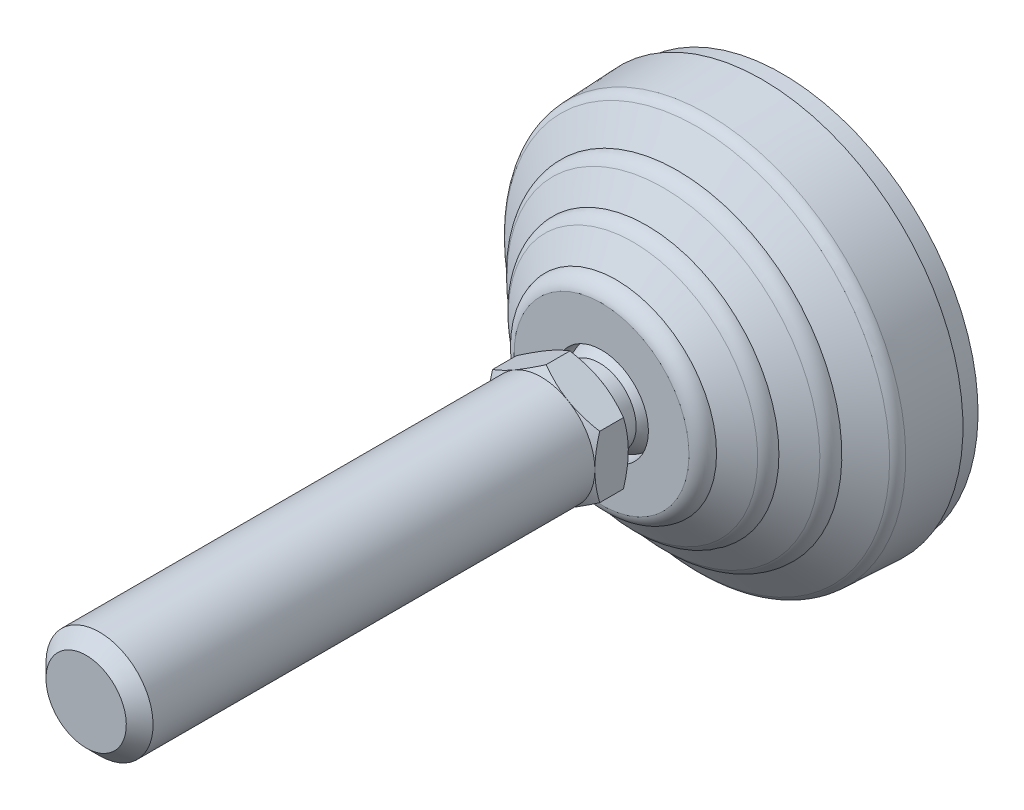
ISO-10303-21;
HEADER;
FILE_DESCRIPTION(('STEP AP214'),'2;1');
FILE_NAME('part.step','',(''),(''),'','','');
FILE_SCHEMA(('AUTOMOTIVE_DESIGN { 1 0 10303 214 1 1 1 1 }'));
ENDSEC;
DATA;
#1=APPLICATION_CONTEXT('core data for automotive mechanical design processes');
#2=APPLICATION_PROTOCOL_DEFINITION('international standard','automotive_design',2000,#1);
#3=PRODUCT_CONTEXT('',#1,'mechanical');
#4=PRODUCT('Part','Part','',(#3));
#5=PRODUCT_RELATED_PRODUCT_CATEGORY('part','',(#4));
#6=PRODUCT_DEFINITION_FORMATION('','',#4);
#7=PRODUCT_DEFINITION_CONTEXT('part definition',#1,'design');
#8=PRODUCT_DEFINITION('design','',#6,#7);
#9=PRODUCT_DEFINITION_SHAPE('','',#8);
#10=(LENGTH_UNIT() NAMED_UNIT(*) SI_UNIT(.MILLI.,.METRE.));
#11=(NAMED_UNIT(*) PLANE_ANGLE_UNIT() SI_UNIT($,.RADIAN.));
#12=(NAMED_UNIT(*) SI_UNIT($,.STERADIAN.) SOLID_ANGLE_UNIT());
#13=UNCERTAINTY_MEASURE_WITH_UNIT(LENGTH_MEASURE(1.E-05),#10,'distance_accuracy_value','');
#14=(GEOMETRIC_REPRESENTATION_CONTEXT(3) GLOBAL_UNCERTAINTY_ASSIGNED_CONTEXT((#13)) GLOBAL_UNIT_ASSIGNED_CONTEXT((#10,
#11,#12)) REPRESENTATION_CONTEXT('',''));
#15=CARTESIAN_POINT('',(0.,0.,0.));
#16=DIRECTION('',(0.,0.,1.));
#17=DIRECTION('',(1.,0.,0.));
#18=AXIS2_PLACEMENT_3D('',#15,#16,#17);
#19=CARTESIAN_POINT('',(0.,0.,35.2753734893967));
#20=DIRECTION('',(0.,0.,-1.));
#21=DIRECTION('',(0.,1.,0.));
#22=AXIS2_PLACEMENT_3D('',#19,#20,#21);
#23=CONICAL_SURFACE('',#22,9.2450899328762,1.0471975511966);
#24=CARTESIAN_POINT('',(0.,0.,36.));
#25=DIRECTION('',(0.,0.,-1.));
#26=DIRECTION('',(0.,1.,0.));
#27=AXIS2_PLACEMENT_3D('',#24,#25,#26);
#28=CIRCLE('',#27,7.99);
#29=CARTESIAN_POINT('',(0.,7.99,36.));
#30=VERTEX_POINT('',#29);
#31=EDGE_CURVE('E124',#30,#30,#28,.F.);
#32=ORIENTED_EDGE('',*,*,#31,.F.);
#33=EDGE_LOOP('',(#32));
#34=FACE_BOUND('',#33,.T.);
#35=CARTESIAN_POINT('',(-4.19327850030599E-08,-9.23760428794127,35.2796952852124));
#36=CARTESIAN_POINT('',(0.175847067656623,-9.13607893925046,35.3382996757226));
#37=CARTESIAN_POINT('',(0.352349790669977,-9.03417505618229,35.3942441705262));
#38=CARTESIAN_POINT('',(0.706788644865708,-8.82953969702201,35.5000807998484));
#39=CARTESIAN_POINT('',(0.884725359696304,-8.72680788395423,35.5499703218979));
#40=CARTESIAN_POINT('',(1.42138431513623,-8.41696768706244,35.6895770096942));
#41=CARTESIAN_POINT('',(1.78222493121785,-8.20863626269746,35.7689823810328));
#42=CARTESIAN_POINT('',(2.32221590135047,-7.896872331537,35.862092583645));
#43=CARTESIAN_POINT('',(2.49975318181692,-7.79437113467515,35.8886165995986));
#44=CARTESIAN_POINT('',(2.85563052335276,-7.58890525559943,35.9330919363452));
#45=CARTESIAN_POINT('',(3.03397051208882,-7.48594061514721,35.9510440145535));
#46=CARTESIAN_POINT('',(3.3909574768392,-7.27983409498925,35.9779205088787));
#47=CARTESIAN_POINT('',(3.56960387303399,-7.17669255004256,35.9868551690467));
#48=CARTESIAN_POINT('',(3.92706158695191,-6.97031424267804,35.9955052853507));
#49=CARTESIAN_POINT('',(4.10587289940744,-6.86707748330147,35.995221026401));
#50=CARTESIAN_POINT('',(4.44015430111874,-6.67408002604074,35.9860752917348));
#51=CARTESIAN_POINT('',(4.59564800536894,-6.58430569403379,35.9783294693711));
#52=CARTESIAN_POINT('',(4.90627121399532,-6.4049673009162,35.956016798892));
#53=CARTESIAN_POINT('',(5.06140069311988,-6.31540325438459,35.9414494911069));
#54=CARTESIAN_POINT('',(5.52618852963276,-6.04705787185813,35.8878596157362));
#55=CARTESIAN_POINT('',(5.83502420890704,-5.86875150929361,35.8389557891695));
#56=CARTESIAN_POINT('',(6.455971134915,-5.51024763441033,35.7166979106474));
#57=CARTESIAN_POINT('',(6.76800315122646,-5.33009586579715,35.6428257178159));
#58=CARTESIAN_POINT('',(7.38741452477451,-4.97247854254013,35.4751673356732));
#59=CARTESIAN_POINT('',(7.69480181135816,-4.79500840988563,35.3814205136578));
#60=CARTESIAN_POINT('',(7.9999999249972,-4.6188021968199,35.2796953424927));
#61=B_SPLINE_CURVE_WITH_KNOTS('',3,(#35,#36,#37,#38,#39,#40,#41,#42,#43,#44,#45,#46,#47,#48,#49,
#50,#51,#52,#53,#54,#55,#56,#57,#58,#59,#60),.UNSPECIFIED.,.F.,.F.,(4,2,2,2,2,2,2,2,2,2,2,2,4),
(0.,0.633965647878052,1.26820386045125,2.53931509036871,3.15930425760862,3.77923863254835,
4.39846794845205,5.01767812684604,5.55669080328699,6.09573980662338,7.17460542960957,
8.2773951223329,9.37802050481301),.UNSPECIFIED.);
#62=CARTESIAN_POINT('',(-1.44240226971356E-08,-9.23760431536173,35.2796953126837));
#63=VERTEX_POINT('',#62);
#64=CARTESIAN_POINT('',(8.,-4.61880217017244,35.2796953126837));
#65=VERTEX_POINT('',#64);
#66=EDGE_CURVE('E140',#63,#65,#61,.T.);
#67=ORIENTED_EDGE('',*,*,#66,.T.);
#68=CARTESIAN_POINT('',(7.9999999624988,-4.6188021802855,35.2796952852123));
#69=CARTESIAN_POINT('',(7.99999998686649,-4.23969380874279,35.3891659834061));
#70=CARTESIAN_POINT('',(7.999999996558,-3.85751175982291,35.4893813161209));
#71=CARTESIAN_POINT('',(8.00000000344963,-3.08693961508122,35.6664987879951));
#72=CARTESIAN_POINT('',(8.00000000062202,-2.69853763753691,35.7433487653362));
#73=CARTESIAN_POINT('',(7.99999999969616,-2.11699996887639,35.8364192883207));
#74=CARTESIAN_POINT('',(7.99999999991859,-1.92560834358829,35.8635449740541));
#75=CARTESIAN_POINT('',(8.0000000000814,-1.54193621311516,35.9104602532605));
#76=CARTESIAN_POINT('',(8.0000000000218,-1.34965578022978,35.9302504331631));
#77=CARTESIAN_POINT('',(7.99999999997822,-0.96464588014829,35.962068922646));
#78=CARTESIAN_POINT('',(7.99999999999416,-0.771917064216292,35.9741050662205));
#79=CARTESIAN_POINT('',(8.00000000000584,-0.386125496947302,35.9901838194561));
#80=CARTESIAN_POINT('',(8.00000000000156,-0.193062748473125,35.9942264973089));
#81=CARTESIAN_POINT('',(7.99999999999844,0.193062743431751,35.9942264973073));
#82=CARTESIAN_POINT('',(7.99999999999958,0.38612548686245,35.9901838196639));
#83=CARTESIAN_POINT('',(8.00000000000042,0.771917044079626,35.9741050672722));
#84=CARTESIAN_POINT('',(8.00000000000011,0.964645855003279,35.962068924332));
#85=CARTESIAN_POINT('',(7.99999999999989,1.34965574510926,35.930250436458));
#86=CARTESIAN_POINT('',(7.99999999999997,1.54193617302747,35.9104602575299));
#87=CARTESIAN_POINT('',(8.00000000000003,1.92560829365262,35.8635449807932));
#88=CARTESIAN_POINT('',(8.00000000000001,2.11699991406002,35.8364192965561));
#89=CARTESIAN_POINT('',(7.99999999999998,2.69853756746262,35.7433487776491));
#90=CARTESIAN_POINT('',(7.99999999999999,3.0869395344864,35.6664988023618));
#91=CARTESIAN_POINT('',(8.00000000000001,3.85751166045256,35.4893813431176));
#92=CARTESIAN_POINT('',(8.00000000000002,4.23969370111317,35.3891660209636));
#93=CARTESIAN_POINT('',(8.,4.61880206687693,35.2796953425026));
#94=B_SPLINE_CURVE_WITH_KNOTS('',3,(#68,#69,#70,#71,#72,#73,#74,#75,#76,#77,#78,#79,#80,#81,#82,
#83,#84,#85,#86,#87,#88,#89,#90,#91,#92,#93),.UNSPECIFIED.,.F.,.F.,(4,2,2,2,2,2,2,2,2,2,2,2,4),
(0.,1.1842935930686,2.37121196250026,2.95099639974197,3.53073447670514,4.10988591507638,
4.68903241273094,5.26817889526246,5.84733031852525,6.42706838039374,7.00685280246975,
8.19377114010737,9.37806470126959),.UNSPECIFIED.);
#95=CARTESIAN_POINT('',(8.00000001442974,4.618802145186,35.2796953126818));
#96=VERTEX_POINT('',#95);
#97=EDGE_CURVE('E132',#65,#96,#94,.T.);
#98=ORIENTED_EDGE('',*,*,#97,.T.);
#99=CARTESIAN_POINT('',(8.00000000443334,4.61880210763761,35.2796952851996));
#100=CARTESIAN_POINT('',(7.82415291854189,4.72032749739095,35.3382996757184));
#101=CARTESIAN_POINT('',(7.64765020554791,4.8222313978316,35.3942441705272));
#102=CARTESIAN_POINT('',(7.29321135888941,5.02686677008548,35.500080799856));
#103=CARTESIAN_POINT('',(7.11527464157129,5.12959857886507,35.549970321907));
#104=CARTESIAN_POINT('',(6.57861568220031,5.43943876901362,35.689577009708));
#105=CARTESIAN_POINT('',(6.21777506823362,5.6477701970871,35.7689823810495));
#106=CARTESIAN_POINT('',(5.67778409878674,5.95953412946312,35.8620925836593));
#107=CARTESIAN_POINT('',(5.50024681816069,6.06203532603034,35.8886165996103));
#108=CARTESIAN_POINT('',(5.14436947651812,6.2675012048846,35.9330919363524));
#109=CARTESIAN_POINT('',(4.96602948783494,6.37046584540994,35.9510440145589));
#110=CARTESIAN_POINT('',(4.60904252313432,6.57657236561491,35.977920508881));
#111=CARTESIAN_POINT('',(4.43039612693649,6.6797139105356,35.986855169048));
#112=CARTESIAN_POINT('',(4.0729384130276,6.88609221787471,35.9955052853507));
#113=CARTESIAN_POINT('',(3.89412710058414,6.98932897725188,35.9952210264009));
#114=CARTESIAN_POINT('',(3.55984569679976,7.18232643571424,35.9860752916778));
#115=CARTESIAN_POINT('',(3.40435199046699,7.27210076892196,35.9783294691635));
#116=CARTESIAN_POINT('',(3.09372877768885,7.45143916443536,35.956016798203));
#117=CARTESIAN_POINT('',(2.9385992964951,7.54100321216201,35.9414494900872));
#118=CARTESIAN_POINT('',(2.47381145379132,7.80934859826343,35.8878596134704));
#119=CARTESIAN_POINT('',(2.16497577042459,7.98765496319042,35.8389557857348));
#120=CARTESIAN_POINT('',(1.54402883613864,8.34615884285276,35.7166979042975));
#121=CARTESIAN_POINT('',(1.23199681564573,8.52631061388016,35.6428257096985));
#122=CARTESIAN_POINT('',(0.612585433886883,8.88392794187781,35.4751673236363));
#123=CARTESIAN_POINT('',(0.305198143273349,9.06139807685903,35.3814204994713));
#124=CARTESIAN_POINT('',(2.56600557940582E-08,9.23760429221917,35.2796953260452));
#125=B_SPLINE_CURVE_WITH_KNOTS('',3,(#99,#100,#101,#102,#103,#104,#105,#106,#107,#108,#109,#110,
#111,#112,#113,#114,#115,#116,#117,#118,#119,#120,#121,#122,#123,#124),.UNSPECIFIED.,.F.,.F.,(4,
2,2,2,2,2,2,2,2,2,2,2,4),(0.,0.63396564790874,1.26820386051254,2.53931509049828,
3.15930425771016,3.77923863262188,4.39846794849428,5.01767812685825,5.55669081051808,
6.0957398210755,7.17460545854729,8.27739516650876,9.37802056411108),.UNSPECIFIED.);
#126=CARTESIAN_POINT('',(-1.1538685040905E-08,9.23760430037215,35.279695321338));
#127=VERTEX_POINT('',#126);
#128=EDGE_CURVE('E176',#96,#127,#125,.T.);
#129=ORIENTED_EDGE('',*,*,#128,.T.);
#130=CARTESIAN_POINT('',(-1.65350869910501E-08,9.23760427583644,35.2796953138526));
#131=CARTESIAN_POINT('',(-0.175847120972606,9.13607891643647,35.3382996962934));
#132=CARTESIAN_POINT('',(-0.352349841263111,9.03417502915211,35.3942441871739));
#133=CARTESIAN_POINT('',(-0.7067886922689,8.82953966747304,35.5000808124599));
#134=CARTESIAN_POINT('',(-0.884725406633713,8.72680785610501,35.5499703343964));
#135=CARTESIAN_POINT('',(-1.42138436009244,8.41696766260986,35.6895770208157));
#136=CARTESIAN_POINT('',(-1.78222497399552,8.2086362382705,35.7689823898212));
#137=CARTESIAN_POINT('',(-2.32221594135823,7.89687230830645,35.8620925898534));
#138=CARTESIAN_POINT('',(-2.4997532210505,7.79437111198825,35.8886166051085));
#139=CARTESIAN_POINT('',(-2.85563056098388,7.58890523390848,35.9330919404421));
#140=CARTESIAN_POINT('',(-3.03397054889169,7.48594059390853,35.9510440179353));
#141=CARTESIAN_POINT('',(-3.39095751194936,7.27983407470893,35.9779205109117));
#142=CARTESIAN_POINT('',(-3.56960390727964,7.1766925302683,35.9868551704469));
#143=CARTESIAN_POINT('',(-3.92706161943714,6.97031422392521,35.9955052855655));
#144=CARTESIAN_POINT('',(-4.10587293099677,6.86707746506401,35.9952210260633));
#145=CARTESIAN_POINT('',(-4.44015433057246,6.67408000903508,35.9860752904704));
#146=CARTESIAN_POINT('',(-4.59564803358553,6.58430567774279,35.9783294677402));
#147=CARTESIAN_POINT('',(-4.90627123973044,6.40496728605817,35.956016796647));
#148=CARTESIAN_POINT('',(-5.06140071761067,6.31540324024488,35.9414494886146));
#149=CARTESIAN_POINT('',(-5.52618855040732,6.04705785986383,35.8878596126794));
#150=CARTESIAN_POINT('',(-5.83502422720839,5.8687514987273,35.8389557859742));
#151=CARTESIAN_POINT('',(-6.45597114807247,5.51024762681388,35.7166979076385));
#152=CARTESIAN_POINT('',(-6.76800316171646,5.33009585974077,35.6428257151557));
#153=CARTESIAN_POINT('',(-7.38741452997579,4.97247853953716,35.4751673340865));
#154=CARTESIAN_POINT('',(-7.69480181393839,4.7950084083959,35.381420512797));
#155=CARTESIAN_POINT('',(-7.9999999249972,4.6188021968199,35.2796953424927));
#156=B_SPLINE_CURVE_WITH_KNOTS('',3,(#130,#131,#132,#133,#134,#135,#136,#137,#138,#139,#140,
#141,#142,#143,#144,#145,#146,#147,#148,#149,#150,#151,#152,#153,#154,#155),.UNSPECIFIED.,.F.,
.F.,(4,2,2,2,2,2,2,2,2,2,2,2,4),(0.,0.633965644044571,1.26820385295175,2.53931507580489,
3.15930423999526,3.77923861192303,4.39846792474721,5.01767810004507,5.55669077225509,
6.09573977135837,7.17460538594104,8.27739506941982,9.37802044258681),.UNSPECIFIED.);
#157=CARTESIAN_POINT('',(-8.,4.61880217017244,35.2796953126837));
#158=VERTEX_POINT('',#157);
#159=EDGE_CURVE('E168',#127,#158,#156,.T.);
#160=ORIENTED_EDGE('',*,*,#159,.T.);
#161=CARTESIAN_POINT('',(-7.9999999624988,4.6188021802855,35.2796952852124));
#162=CARTESIAN_POINT('',(-7.99999998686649,4.23969380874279,35.3891659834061));
#163=CARTESIAN_POINT('',(-7.999999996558,3.8575117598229,35.4893813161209));
#164=CARTESIAN_POINT('',(-8.00000000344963,3.08693961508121,35.6664987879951));
#165=CARTESIAN_POINT('',(-8.00000000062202,2.69853763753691,35.7433487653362));
#166=CARTESIAN_POINT('',(-7.99999999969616,2.11699996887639,35.8364192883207));
#167=CARTESIAN_POINT('',(-7.99999999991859,1.92560834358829,35.8635449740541));
#168=CARTESIAN_POINT('',(-8.0000000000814,1.54193621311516,35.9104602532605));
#169=CARTESIAN_POINT('',(-8.0000000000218,1.34965578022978,35.9302504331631));
#170=CARTESIAN_POINT('',(-7.99999999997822,0.964645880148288,35.962068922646));
#171=CARTESIAN_POINT('',(-7.99999999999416,0.77191706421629,35.9741050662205));
#172=CARTESIAN_POINT('',(-8.00000000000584,0.386125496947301,35.9901838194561));
#173=CARTESIAN_POINT('',(-8.00000000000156,0.193062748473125,35.9942264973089));
#174=CARTESIAN_POINT('',(-7.99999999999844,-0.193062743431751,35.9942264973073));
#175=CARTESIAN_POINT('',(-7.99999999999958,-0.38612548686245,35.9901838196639));
#176=CARTESIAN_POINT('',(-8.00000000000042,-0.771917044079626,35.9741050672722));
#177=CARTESIAN_POINT('',(-8.00000000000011,-0.964645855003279,35.962068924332));
#178=CARTESIAN_POINT('',(-7.99999999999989,-1.34965574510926,35.930250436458));
#179=CARTESIAN_POINT('',(-7.99999999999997,-1.54193617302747,35.9104602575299));
#180=CARTESIAN_POINT('',(-8.00000000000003,-1.92560829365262,35.8635449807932));
#181=CARTESIAN_POINT('',(-8.00000000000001,-2.11699991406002,35.8364192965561));
#182=CARTESIAN_POINT('',(-7.99999999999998,-2.69853756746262,35.7433487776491));
#183=CARTESIAN_POINT('',(-7.99999999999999,-3.0869395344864,35.6664988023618));
#184=CARTESIAN_POINT('',(-8.00000000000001,-3.85751166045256,35.4893813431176));
#185=CARTESIAN_POINT('',(-8.00000000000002,-4.23969370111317,35.3891660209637));
#186=CARTESIAN_POINT('',(-8.,-4.61880206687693,35.2796953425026));
#187=B_SPLINE_CURVE_WITH_KNOTS('',3,(#161,#162,#163,#164,#165,#166,#167,#168,#169,#170,#171,
#172,#173,#174,#175,#176,#177,#178,#179,#180,#181,#182,#183,#184,#185,#186),.UNSPECIFIED.,.F.,
.F.,(4,2,2,2,2,2,2,2,2,2,2,2,4),(0.,1.1842935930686,2.37121196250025,2.95099639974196,
3.53073447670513,4.10988591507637,4.68903241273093,5.26817889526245,5.84733031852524,
6.42706838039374,7.00685280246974,8.19377114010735,9.37806470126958),.UNSPECIFIED.);
#188=CARTESIAN_POINT('',(-8.00000001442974,-4.61880214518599,35.2796953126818));
#189=VERTEX_POINT('',#188);
#190=EDGE_CURVE('E357',#158,#189,#187,.T.);
#191=ORIENTED_EDGE('',*,*,#190,.T.);
#192=CARTESIAN_POINT('',(-8.00000000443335,-4.61880210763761,35.2796952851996));
#193=CARTESIAN_POINT('',(-7.82415291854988,-4.72032749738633,35.3382996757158));
#194=CARTESIAN_POINT('',(-7.64765020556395,-4.82223139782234,35.3942441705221));
#195=CARTESIAN_POINT('',(-7.29321135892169,-5.02686677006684,35.5000807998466));
#196=CARTESIAN_POINT('',(-7.11527464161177,-5.1295985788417,35.5499703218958));
#197=CARTESIAN_POINT('',(-6.57861568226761,-5.43943876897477,35.6895770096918));
#198=CARTESIAN_POINT('',(-6.21777506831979,-5.64777019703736,35.7689823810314));
#199=CARTESIAN_POINT('',(-5.67778409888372,-5.95953412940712,35.8620925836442));
#200=CARTESIAN_POINT('',(-5.50024681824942,-6.06203532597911,35.8886165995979));
#201=CARTESIAN_POINT('',(-5.14436947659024,-6.26750120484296,35.9330919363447));
#202=CARTESIAN_POINT('',(-4.9660294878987,-6.37046584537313,35.9510440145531));
#203=CARTESIAN_POINT('',(-4.60904252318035,-6.57657236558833,35.9779205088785));
#204=CARTESIAN_POINT('',(-4.43039612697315,-6.67971391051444,35.9868551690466));
#205=CARTESIAN_POINT('',(-4.07293841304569,-6.88609221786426,35.9955052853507));
#206=CARTESIAN_POINT('',(-3.89412710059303,-6.98932897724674,35.995221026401));
#207=CARTESIAN_POINT('',(-3.55984569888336,-7.18232643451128,35.9860752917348));
#208=CARTESIAN_POINT('',(-3.40435199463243,-7.27210076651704,35.9783294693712));
#209=CARTESIAN_POINT('',(-3.09372878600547,-7.45143915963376,35.9560167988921));
#210=CARTESIAN_POINT('',(-2.93859930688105,-7.54100320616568,35.941449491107));
#211=CARTESIAN_POINT('',(-2.47381147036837,-7.80934858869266,35.8878596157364));
#212=CARTESIAN_POINT('',(-2.16497579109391,-7.98765495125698,35.8389557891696));
#213=CARTESIAN_POINT('',(-1.54402886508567,-8.34615882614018,35.7166979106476));
#214=CARTESIAN_POINT('',(-1.23199684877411,-8.52631059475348,35.642825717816));
#215=CARTESIAN_POINT('',(-0.612585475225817,-8.88392791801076,35.4751673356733));
#216=CARTESIAN_POINT('',(-0.305198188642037,-9.06139805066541,35.3814205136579));
#217=CARTESIAN_POINT('',(-7.50027841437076E-08,-9.23760426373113,35.2796953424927));
#218=B_SPLINE_CURVE_WITH_KNOTS('',3,(#192,#193,#194,#195,#196,#197,#198,#199,#200,#201,#202,
#203,#204,#205,#206,#207,#208,#209,#210,#211,#212,#213,#214,#215,#216,#217),.UNSPECIFIED.,.F.,
.F.,(4,2,2,2,2,2,2,2,2,2,2,2,4),(0.,0.633965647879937,1.26820386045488,2.53931509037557,
3.15930425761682,3.77923863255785,4.39846794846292,5.01767812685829,5.55669080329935,
6.09573980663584,7.17460542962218,8.27739512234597,9.37802050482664),.UNSPECIFIED.);
#219=EDGE_CURVE('E158',#189,#63,#218,.T.);
#220=ORIENTED_EDGE('',*,*,#219,.T.);
#221=EDGE_LOOP('',(#67,#98,#129,#160,#191,#220));
#222=FACE_BOUND('',#221,.T.);
#223=ADVANCED_FACE('F14',(#34,#222),#23,.T.);
#224=CARTESIAN_POINT('',(0.,-9.23760430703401,36.1));
#225=DIRECTION('',(0.5,0.866025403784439,0.));
#226=DIRECTION('',(-0.866025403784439,0.5,0.));
#227=AXIS2_PLACEMENT_3D('',#224,#225,#226);
#228=PLANE('',#227);
#229=DIRECTION('',(0.,0.,1.));
#230=VECTOR('',#229,1.);
#231=CARTESIAN_POINT('',(0.,-9.23760430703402,36.1));
#232=LINE('',#231,#230);
#233=CARTESIAN_POINT('',(0.,-9.23760430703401,31.7203046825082));
#234=VERTEX_POINT('',#233);
#235=EDGE_CURVE('E338',#234,#63,#232,.T.);
#236=ORIENTED_EDGE('',*,*,#235,.T.);
#237=ORIENTED_EDGE('',*,*,#219,.F.);
#238=DIRECTION('',(0.,0.,1.));
#239=VECTOR('',#238,1.);
#240=CARTESIAN_POINT('',(-8.,-4.61880215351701,36.1));
#241=LINE('',#240,#239);
#242=CARTESIAN_POINT('',(-8.,-4.61880215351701,31.7203046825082));
#243=VERTEX_POINT('',#242);
#244=EDGE_CURVE('E341',#243,#189,#241,.T.);
#245=ORIENTED_EDGE('',*,*,#244,.F.);
#246=CARTESIAN_POINT('',(0.,-9.23760430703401,31.7203046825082));
#247=CARTESIAN_POINT('',(-0.175847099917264,-9.13607893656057,31.6617003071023));
#248=CARTESIAN_POINT('',(-0.352349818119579,-9.03417504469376,31.6057558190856));
#249=CARTESIAN_POINT('',(-0.706788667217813,-8.82953967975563,31.4999191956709));
#250=CARTESIAN_POINT('',(-0.884725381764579,-8.72680786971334,31.4500296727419));
#251=CARTESIAN_POINT('',(-1.42138433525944,-8.41696767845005,31.3104229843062));
#252=CARTESIAN_POINT('',(-1.78222494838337,-8.20863625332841,31.2310176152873));
#253=CARTESIAN_POINT('',(-2.32221591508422,-7.8968723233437,31.1379074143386));
#254=CARTESIAN_POINT('',(-2.49975319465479,-7.79437112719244,31.1113833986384));
#255=CARTESIAN_POINT('',(-2.85563053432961,-7.5889052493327,31.0669080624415));
#256=CARTESIAN_POINT('',(-3.03397052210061,-7.48594060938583,31.0489559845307));
#257=CARTESIAN_POINT('',(-3.39095748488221,-7.27983409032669,31.0220794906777));
#258=CARTESIAN_POINT('',(-3.56960388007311,-7.17669254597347,31.0131448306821));
#259=CARTESIAN_POINT('',(-3.9270615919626,-6.97031423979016,31.0044947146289));
#260=CARTESIAN_POINT('',(-4.10587290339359,-6.86707748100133,31.0047789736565));
#261=CARTESIAN_POINT('',(-4.44015430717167,-6.67408002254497,31.0139247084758));
#262=CARTESIAN_POINT('',(-4.59564801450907,-6.58430568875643,31.0216705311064));
#263=CARTESIAN_POINT('',(-4.90627122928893,-6.40496729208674,31.0439832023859));
#264=CARTESIAN_POINT('',(-5.06140071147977,-6.3154032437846,31.0585505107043));
#265=CARTESIAN_POINT('',(-5.52618855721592,-6.04705785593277,31.1121403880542));
#266=CARTESIAN_POINT('',(-5.83502424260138,-5.86875148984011,31.161044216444));
#267=CARTESIAN_POINT('',(-6.4559711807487,-5.51024760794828,31.283302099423));
#268=CARTESIAN_POINT('',(-6.76800320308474,-5.33009583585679,31.3571742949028));
#269=CARTESIAN_POINT('',(-7.38741458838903,-4.97247850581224,31.5248326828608));
#270=CARTESIAN_POINT('',(-7.69480188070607,-4.79500836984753,31.6185795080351));
#271=CARTESIAN_POINT('',(-8.,-4.61880215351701,31.7203046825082));
#272=B_SPLINE_CURVE_WITH_KNOTS('',3,(#246,#247,#248,#249,#250,#251,#252,#253,#254,#255,#256,
#257,#258,#259,#260,#261,#262,#263,#264,#265,#266,#267,#268,#269,#270,#271),.UNSPECIFIED.,.F.,
.F.,(4,2,2,2,2,2,2,2,2,2,2,2,4),(0.,0.633965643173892,1.26820385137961,2.53931507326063,
3.15930423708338,3.77923860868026,4.39846792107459,5.01767809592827,5.55669078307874,
6.09573979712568,7.17460544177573,8.27739515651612,9.37802056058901),.UNSPECIFIED.);
#273=EDGE_CURVE('E340',#234,#243,#272,.T.);
#274=ORIENTED_EDGE('',*,*,#273,.F.);
#275=EDGE_LOOP('',(#236,#237,#245,#274));
#276=FACE_BOUND('',#275,.T.);
#277=ADVANCED_FACE('F152',(#276),#228,.F.);
#278=CARTESIAN_POINT('',(8.,-4.61880215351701,36.1));
#279=DIRECTION('',(-0.5,0.866025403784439,0.));
#280=DIRECTION('',(-0.866025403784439,-0.5,0.));
#281=AXIS2_PLACEMENT_3D('',#278,#279,#280);
#282=PLANE('',#281);
#283=DIRECTION('',(0.,0.,1.));
#284=VECTOR('',#283,1.);
#285=CARTESIAN_POINT('',(8.,-4.61880215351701,36.1));
#286=LINE('',#285,#284);
#287=CARTESIAN_POINT('',(8.,-4.61880215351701,31.7203046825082));
#288=VERTEX_POINT('',#287);
#289=EDGE_CURVE('E31',#288,#65,#286,.T.);
#290=ORIENTED_EDGE('',*,*,#289,.T.);
#291=ORIENTED_EDGE('',*,*,#66,.F.);
#292=ORIENTED_EDGE('',*,*,#235,.F.);
#293=CARTESIAN_POINT('',(8.,-4.61880215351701,31.7203046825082));
#294=CARTESIAN_POINT('',(7.82415290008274,-4.72032752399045,31.6617003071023));
#295=CARTESIAN_POINT('',(7.64765018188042,-4.82223141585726,31.6057558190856));
#296=CARTESIAN_POINT('',(7.29321133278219,-5.02686678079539,31.4999191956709));
#297=CARTESIAN_POINT('',(7.11527461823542,-5.12959859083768,31.4500296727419));
#298=CARTESIAN_POINT('',(6.57861566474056,-5.43943878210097,31.3104229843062));
#299=CARTESIAN_POINT('',(6.21777505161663,-5.64777020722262,31.2310176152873));
#300=CARTESIAN_POINT('',(5.67778408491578,-5.95953413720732,31.1379074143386));
#301=CARTESIAN_POINT('',(5.5002468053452,-6.06203533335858,31.1113833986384));
#302=CARTESIAN_POINT('',(5.14436946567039,-6.26750121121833,31.0669080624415));
#303=CARTESIAN_POINT('',(4.96602947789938,-6.37046585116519,31.0489559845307));
#304=CARTESIAN_POINT('',(4.60904251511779,-6.57657237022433,31.0220794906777));
#305=CARTESIAN_POINT('',(4.43039611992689,-6.67971391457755,31.0131448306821));
#306=CARTESIAN_POINT('',(4.0729384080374,-6.88609222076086,31.0044947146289));
#307=CARTESIAN_POINT('',(3.8941270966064,-6.98932897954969,31.0047789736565));
#308=CARTESIAN_POINT('',(3.55984569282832,-7.18232643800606,31.0139247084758));
#309=CARTESIAN_POINT('',(3.40435198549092,-7.27210077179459,31.0216705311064));
#310=CARTESIAN_POINT('',(3.09372877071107,-7.45143916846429,31.0439832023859));
#311=CARTESIAN_POINT('',(2.93859928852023,-7.54100321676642,31.0585505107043));
#312=CARTESIAN_POINT('',(2.47381144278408,-7.80934860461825,31.1121403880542));
#313=CARTESIAN_POINT('',(2.16497575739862,-7.98765497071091,31.161044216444));
#314=CARTESIAN_POINT('',(1.5440288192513,-8.34615885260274,31.283302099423));
#315=CARTESIAN_POINT('',(1.23199679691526,-8.52631062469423,31.3571742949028));
#316=CARTESIAN_POINT('',(0.612585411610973,-8.88392795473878,31.5248326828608));
#317=CARTESIAN_POINT('',(0.305198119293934,-9.0613980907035,31.6185795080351));
#318=CARTESIAN_POINT('',(0.,-9.23760430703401,31.7203046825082));
#319=B_SPLINE_CURVE_WITH_KNOTS('',3,(#293,#294,#295,#296,#297,#298,#299,#300,#301,#302,#303,
#304,#305,#306,#307,#308,#309,#310,#311,#312,#313,#314,#315,#316,#317,#318),.UNSPECIFIED.,.F.,
.F.,(4,2,2,2,2,2,2,2,2,2,2,2,4),(0.,0.633965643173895,1.26820385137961,2.53931507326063,
3.15930423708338,3.77923860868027,4.3984679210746,5.01767809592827,5.55669078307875,
6.09573979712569,7.17460544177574,8.27739515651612,9.37802056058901),.UNSPECIFIED.);
#320=EDGE_CURVE('E337',#288,#234,#319,.T.);
#321=ORIENTED_EDGE('',*,*,#320,.F.);
#322=EDGE_LOOP('',(#290,#291,#292,#321));
#323=FACE_BOUND('',#322,.T.);
#324=ADVANCED_FACE('F364',(#323),#282,.F.);
#325=CARTESIAN_POINT('',(-8.,4.61880215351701,36.1));
#326=DIRECTION('',(0.5,-0.866025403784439,0.));
#327=DIRECTION('',(0.866025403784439,0.5,0.));
#328=AXIS2_PLACEMENT_3D('',#325,#326,#327);
#329=PLANE('',#328);
#330=DIRECTION('',(0.,0.,1.));
#331=VECTOR('',#330,1.);
#332=CARTESIAN_POINT('',(-8.,4.61880215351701,36.1));
#333=LINE('',#332,#331);
#334=CARTESIAN_POINT('',(-8.,4.61880215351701,31.7203046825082));
#335=VERTEX_POINT('',#334);
#336=EDGE_CURVE('E344',#335,#158,#333,.T.);
#337=ORIENTED_EDGE('',*,*,#336,.T.);
#338=ORIENTED_EDGE('',*,*,#159,.F.);
#339=DIRECTION('',(0.,0.,1.));
#340=VECTOR('',#339,1.);
#341=CARTESIAN_POINT('',(0.,9.23760430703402,36.1));
#342=LINE('',#341,#340);
#343=CARTESIAN_POINT('',(0.,9.23760430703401,31.7203046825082));
#344=VERTEX_POINT('',#343);
#345=EDGE_CURVE('E207',#344,#127,#342,.T.);
#346=ORIENTED_EDGE('',*,*,#345,.F.);
#347=CARTESIAN_POINT('',(-8.,4.61880215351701,31.7203046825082));
#348=CARTESIAN_POINT('',(-7.82415290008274,4.72032752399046,31.6617003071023));
#349=CARTESIAN_POINT('',(-7.64765018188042,4.82223141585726,31.6057558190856));
#350=CARTESIAN_POINT('',(-7.29321133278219,5.02686678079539,31.4999191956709));
#351=CARTESIAN_POINT('',(-7.11527461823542,5.12959859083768,31.4500296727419));
#352=CARTESIAN_POINT('',(-6.57861566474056,5.43943878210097,31.3104229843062));
#353=CARTESIAN_POINT('',(-6.21777505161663,5.64777020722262,31.2310176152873));
#354=CARTESIAN_POINT('',(-5.67778408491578,5.95953413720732,31.1379074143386));
#355=CARTESIAN_POINT('',(-5.50024680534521,6.06203533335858,31.1113833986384));
#356=CARTESIAN_POINT('',(-5.14436946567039,6.26750121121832,31.0669080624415));
#357=CARTESIAN_POINT('',(-4.96602947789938,6.37046585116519,31.0489559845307));
#358=CARTESIAN_POINT('',(-4.60904251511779,6.57657237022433,31.0220794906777));
#359=CARTESIAN_POINT('',(-4.43039611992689,6.67971391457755,31.0131448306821));
#360=CARTESIAN_POINT('',(-4.07293840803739,6.88609222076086,31.0044947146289));
#361=CARTESIAN_POINT('',(-3.8941270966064,6.98932897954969,31.0047789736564));
#362=CARTESIAN_POINT('',(-3.55984569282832,7.18232643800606,31.0139247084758));
#363=CARTESIAN_POINT('',(-3.40435198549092,7.27210077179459,31.0216705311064));
#364=CARTESIAN_POINT('',(-3.09372877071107,7.45143916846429,31.0439832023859));
#365=CARTESIAN_POINT('',(-2.93859928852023,7.54100321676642,31.0585505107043));
#366=CARTESIAN_POINT('',(-2.47381144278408,7.80934860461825,31.1121403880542));
#367=CARTESIAN_POINT('',(-2.16497575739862,7.98765497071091,31.161044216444));
#368=CARTESIAN_POINT('',(-1.5440288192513,8.34615885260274,31.2833020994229));
#369=CARTESIAN_POINT('',(-1.23199679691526,8.52631062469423,31.3571742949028));
#370=CARTESIAN_POINT('',(-0.612585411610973,8.88392795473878,31.5248326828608));
#371=CARTESIAN_POINT('',(-0.305198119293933,9.06139809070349,31.6185795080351));
#372=CARTESIAN_POINT('',(0.,9.23760430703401,31.7203046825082));
#373=B_SPLINE_CURVE_WITH_KNOTS('',3,(#347,#348,#349,#350,#351,#352,#353,#354,#355,#356,#357,
#358,#359,#360,#361,#362,#363,#364,#365,#366,#367,#368,#369,#370,#371,#372),.UNSPECIFIED.,.F.,
.F.,(4,2,2,2,2,2,2,2,2,2,2,2,4),(0.,0.633965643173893,1.26820385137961,2.53931507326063,
3.15930423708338,3.77923860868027,4.3984679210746,5.01767809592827,5.55669078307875,
6.09573979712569,7.17460544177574,8.27739515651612,9.37802056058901),.UNSPECIFIED.);
#374=EDGE_CURVE('E209',#335,#344,#373,.T.);
#375=ORIENTED_EDGE('',*,*,#374,.F.);
#376=EDGE_LOOP('',(#337,#338,#346,#375));
#377=FACE_BOUND('',#376,.T.);
#378=ADVANCED_FACE('F195',(#377),#329,.F.);
#379=CARTESIAN_POINT('',(-8.,-4.61880215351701,36.1));
#380=DIRECTION('',(1.,0.,0.));
#381=DIRECTION('',(0.,1.,0.));
#382=AXIS2_PLACEMENT_3D('',#379,#380,#381);
#383=PLANE('',#382);
#384=ORIENTED_EDGE('',*,*,#244,.T.);
#385=ORIENTED_EDGE('',*,*,#190,.F.);
#386=ORIENTED_EDGE('',*,*,#336,.F.);
#387=CARTESIAN_POINT('',(-8.,-4.618802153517,31.7203046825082));
#388=CARTESIAN_POINT('',(-8.,-4.23969378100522,31.610834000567));
#389=CARTESIAN_POINT('',(-8.,-3.85751173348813,31.5106186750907));
#390=CARTESIAN_POINT('',(-8.,-3.08693959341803,31.3335012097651));
#391=CARTESIAN_POINT('',(-8.,-2.69853761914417,31.2566512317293));
#392=CARTESIAN_POINT('',(-8.,-2.11699995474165,31.163580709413));
#393=CARTESIAN_POINT('',(-8.,-1.92560833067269,31.1364550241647));
#394=CARTESIAN_POINT('',(-8.,-1.54193620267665,31.089539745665));
#395=CARTESIAN_POINT('',(-8.,-1.3496557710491,31.069749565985));
#396=CARTESIAN_POINT('',(-8.,-0.964645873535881,31.0379310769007));
#397=CARTESIAN_POINT('',(-8.,-0.771917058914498,31.0258949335));
#398=CARTESIAN_POINT('',(-8.,-0.386125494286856,31.0098161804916));
#399=CARTESIAN_POINT('',(-8.,-0.193062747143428,31.0057735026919));
#400=CARTESIAN_POINT('',(-8.,0.193062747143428,31.0057735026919));
#401=CARTESIAN_POINT('',(-8.,0.386125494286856,31.0098161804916));
#402=CARTESIAN_POINT('',(-8.,0.771917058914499,31.0258949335));
#403=CARTESIAN_POINT('',(-8.,0.964645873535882,31.0379310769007));
#404=CARTESIAN_POINT('',(-8.,1.3496557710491,31.069749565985));
#405=CARTESIAN_POINT('',(-8.,1.54193620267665,31.089539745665));
#406=CARTESIAN_POINT('',(-8.,1.9256083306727,31.1364550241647));
#407=CARTESIAN_POINT('',(-8.,2.11699995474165,31.163580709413));
#408=CARTESIAN_POINT('',(-8.,2.69853761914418,31.2566512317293));
#409=CARTESIAN_POINT('',(-8.,3.08693959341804,31.3335012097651));
#410=CARTESIAN_POINT('',(-8.,3.85751173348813,31.5106186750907));
#411=CARTESIAN_POINT('',(-8.,4.23969378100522,31.610834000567));
#412=CARTESIAN_POINT('',(-8.,4.61880215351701,31.7203046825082));
#413=B_SPLINE_CURVE_WITH_KNOTS('',3,(#387,#388,#389,#390,#391,#392,#393,#394,#395,#396,#397,
#398,#399,#400,#401,#402,#403,#404,#405,#406,#407,#408,#409,#410,#411,#412),.UNSPECIFIED.,.F.,
.F.,(4,2,2,2,2,2,2,2,2,2,2,2,4),(0.,1.18429358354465,2.37121194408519,2.95099637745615,
3.53073445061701,4.10988588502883,4.68903237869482,5.26817887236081,5.84733030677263,
6.42706837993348,7.00685281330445,8.19377117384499,9.37806475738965),.UNSPECIFIED.);
#414=EDGE_CURVE('E343',#243,#335,#413,.T.);
#415=ORIENTED_EDGE('',*,*,#414,.F.);
#416=EDGE_LOOP('',(#384,#385,#386,#415));
#417=FACE_BOUND('',#416,.T.);
#418=ADVANCED_FACE('F380',(#417),#383,.F.);
#419=CARTESIAN_POINT('',(8.,4.61880215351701,36.1));
#420=DIRECTION('',(-1.,0.,0.));
#421=DIRECTION('',(0.,-1.,0.));
#422=AXIS2_PLACEMENT_3D('',#419,#420,#421);
#423=PLANE('',#422);
#424=DIRECTION('',(0.,0.,1.));
#425=VECTOR('',#424,1.);
#426=CARTESIAN_POINT('',(8.,4.61880215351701,36.1));
#427=LINE('',#426,#425);
#428=CARTESIAN_POINT('',(8.,4.61880215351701,31.7203046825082));
#429=VERTEX_POINT('',#428);
#430=EDGE_CURVE('E334',#96,#429,#427,.F.);
#431=ORIENTED_EDGE('',*,*,#430,.F.);
#432=ORIENTED_EDGE('',*,*,#97,.F.);
#433=ORIENTED_EDGE('',*,*,#289,.F.);
#434=CARTESIAN_POINT('',(8.,4.618802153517,31.7203046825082));
#435=CARTESIAN_POINT('',(8.,4.23969378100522,31.610834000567));
#436=CARTESIAN_POINT('',(8.,3.85751173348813,31.5106186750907));
#437=CARTESIAN_POINT('',(8.,3.08693959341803,31.3335012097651));
#438=CARTESIAN_POINT('',(8.,2.69853761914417,31.2566512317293));
#439=CARTESIAN_POINT('',(8.,2.11699995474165,31.163580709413));
#440=CARTESIAN_POINT('',(8.,1.92560833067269,31.1364550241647));
#441=CARTESIAN_POINT('',(8.,1.54193620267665,31.089539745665));
#442=CARTESIAN_POINT('',(8.,1.3496557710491,31.069749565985));
#443=CARTESIAN_POINT('',(8.,0.964645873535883,31.0379310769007));
#444=CARTESIAN_POINT('',(8.,0.7719170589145,31.0258949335));
#445=CARTESIAN_POINT('',(8.,0.386125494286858,31.0098161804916));
#446=CARTESIAN_POINT('',(8.,0.19306274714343,31.0057735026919));
#447=CARTESIAN_POINT('',(8.,-0.193062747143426,31.0057735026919));
#448=CARTESIAN_POINT('',(8.,-0.386125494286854,31.0098161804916));
#449=CARTESIAN_POINT('',(8.,-0.771917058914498,31.0258949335));
#450=CARTESIAN_POINT('',(8.,-0.96464587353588,31.0379310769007));
#451=CARTESIAN_POINT('',(8.,-1.3496557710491,31.069749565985));
#452=CARTESIAN_POINT('',(8.,-1.54193620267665,31.089539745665));
#453=CARTESIAN_POINT('',(8.,-1.9256083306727,31.1364550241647));
#454=CARTESIAN_POINT('',(8.,-2.11699995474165,31.163580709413));
#455=CARTESIAN_POINT('',(8.,-2.69853761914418,31.2566512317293));
#456=CARTESIAN_POINT('',(8.,-3.08693959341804,31.3335012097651));
#457=CARTESIAN_POINT('',(8.,-3.85751173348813,31.5106186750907));
#458=CARTESIAN_POINT('',(8.,-4.23969378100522,31.610834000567));
#459=CARTESIAN_POINT('',(8.,-4.61880215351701,31.7203046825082));
#460=B_SPLINE_CURVE_WITH_KNOTS('',3,(#434,#435,#436,#437,#438,#439,#440,#441,#442,#443,#444,
#445,#446,#447,#448,#449,#450,#451,#452,#453,#454,#455,#456,#457,#458,#459),.UNSPECIFIED.,.F.,
.F.,(4,2,2,2,2,2,2,2,2,2,2,2,4),(0.,1.18429358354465,2.37121194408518,2.95099637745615,
3.53073445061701,4.10988588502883,4.68903237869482,5.26817887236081,5.84733030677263,
6.42706837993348,7.00685281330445,8.193771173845,9.37806475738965),.UNSPECIFIED.);
#461=EDGE_CURVE('E184',#429,#288,#460,.T.);
#462=ORIENTED_EDGE('',*,*,#461,.F.);
#463=EDGE_LOOP('',(#431,#432,#433,#462));
#464=FACE_BOUND('',#463,.T.);
#465=ADVANCED_FACE('F147',(#464),#423,.F.);
#466=CARTESIAN_POINT('',(0.,9.23760430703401,36.1));
#467=DIRECTION('',(-0.5,-0.866025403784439,0.));
#468=DIRECTION('',(0.866025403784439,-0.5,0.));
#469=AXIS2_PLACEMENT_3D('',#466,#467,#468);
#470=PLANE('',#469);
#471=ORIENTED_EDGE('',*,*,#345,.T.);
#472=ORIENTED_EDGE('',*,*,#128,.F.);
#473=ORIENTED_EDGE('',*,*,#430,.T.);
#474=CARTESIAN_POINT('',(0.,9.23760430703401,31.7203046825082));
#475=CARTESIAN_POINT('',(0.175847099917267,9.13607893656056,31.6617003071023));
#476=CARTESIAN_POINT('',(0.352349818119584,9.03417504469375,31.6057558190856));
#477=CARTESIAN_POINT('',(0.706788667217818,8.82953967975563,31.4999191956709));
#478=CARTESIAN_POINT('',(0.884725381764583,8.72680786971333,31.4500296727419));
#479=CARTESIAN_POINT('',(1.42138433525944,8.41696767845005,31.3104229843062));
#480=CARTESIAN_POINT('',(1.78222494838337,8.20863625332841,31.2310176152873));
#481=CARTESIAN_POINT('',(2.32221591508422,7.8968723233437,31.1379074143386));
#482=CARTESIAN_POINT('',(2.4997531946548,7.79437112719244,31.1113833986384));
#483=CARTESIAN_POINT('',(2.85563053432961,7.5889052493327,31.0669080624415));
#484=CARTESIAN_POINT('',(3.03397052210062,7.48594060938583,31.0489559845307));
#485=CARTESIAN_POINT('',(3.39095748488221,7.27983409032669,31.0220794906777));
#486=CARTESIAN_POINT('',(3.56960388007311,7.17669254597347,31.0131448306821));
#487=CARTESIAN_POINT('',(3.92706159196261,6.97031423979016,31.0044947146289));
#488=CARTESIAN_POINT('',(4.1058729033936,6.86707748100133,31.0047789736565));
#489=CARTESIAN_POINT('',(4.44015430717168,6.67408002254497,31.0139247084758));
#490=CARTESIAN_POINT('',(4.59564801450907,6.58430568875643,31.0216705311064));
#491=CARTESIAN_POINT('',(4.90627122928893,6.40496729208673,31.0439832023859));
#492=CARTESIAN_POINT('',(5.06140071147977,6.3154032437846,31.0585505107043));
#493=CARTESIAN_POINT('',(5.52618855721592,6.04705785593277,31.1121403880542));
#494=CARTESIAN_POINT('',(5.83502424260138,5.86875148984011,31.161044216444));
#495=CARTESIAN_POINT('',(6.4559711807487,5.51024760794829,31.2833020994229));
#496=CARTESIAN_POINT('',(6.76800320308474,5.33009583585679,31.3571742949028));
#497=CARTESIAN_POINT('',(7.38741458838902,4.97247850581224,31.5248326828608));
#498=CARTESIAN_POINT('',(7.69480188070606,4.79500836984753,31.6185795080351));
#499=CARTESIAN_POINT('',(8.,4.61880215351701,31.7203046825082));
#500=B_SPLINE_CURVE_WITH_KNOTS('',3,(#474,#475,#476,#477,#478,#479,#480,#481,#482,#483,#484,
#485,#486,#487,#488,#489,#490,#491,#492,#493,#494,#495,#496,#497,#498,#499),.UNSPECIFIED.,.F.,
.F.,(4,2,2,2,2,2,2,2,2,2,2,2,4),(0.,0.633965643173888,1.2682038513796,2.53931507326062,
3.15930423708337,3.77923860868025,4.39846792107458,5.01767809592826,5.55669078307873,
6.09573979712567,7.17460544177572,8.2773951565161,9.37802056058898),.UNSPECIFIED.);
#501=EDGE_CURVE('E68',#344,#429,#500,.T.);
#502=ORIENTED_EDGE('',*,*,#501,.F.);
#503=EDGE_LOOP('',(#471,#472,#473,#502));
#504=FACE_BOUND('',#503,.T.);
#505=ADVANCED_FACE('F191',(#504),#470,.F.);
#506=CARTESIAN_POINT('',(0.,0.,31.7246265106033));
#507=DIRECTION('',(0.,0.,1.));
#508=DIRECTION('',(0.,-1.,0.));
#509=AXIS2_PLACEMENT_3D('',#506,#507,#508);
#510=CONICAL_SURFACE('',#509,9.24508993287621,1.0471975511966);
#511=CARTESIAN_POINT('',(0.,0.,31.));
#512=DIRECTION('',(0.,0.,1.));
#513=DIRECTION('',(0.,-1.,0.));
#514=AXIS2_PLACEMENT_3D('',#511,#512,#513);
#515=CIRCLE('',#514,7.99);
#516=CARTESIAN_POINT('',(0.,-7.99,31.));
#517=VERTEX_POINT('',#516);
#518=EDGE_CURVE('E208',#517,#517,#515,.T.);
#519=ORIENTED_EDGE('',*,*,#518,.T.);
#520=EDGE_LOOP('',(#519));
#521=FACE_BOUND('',#520,.T.);
#522=ORIENTED_EDGE('',*,*,#501,.T.);
#523=ORIENTED_EDGE('',*,*,#461,.T.);
#524=ORIENTED_EDGE('',*,*,#320,.T.);
#525=ORIENTED_EDGE('',*,*,#273,.T.);
#526=ORIENTED_EDGE('',*,*,#414,.T.);
#527=ORIENTED_EDGE('',*,*,#374,.T.);
#528=EDGE_LOOP('',(#522,#523,#524,#525,#526,#527));
#529=FACE_BOUND('',#528,.T.);
#530=ADVANCED_FACE('F194',(#521,#529),#510,.T.);
#531=CARTESIAN_POINT('',(6.745,0.,31.));
#532=DIRECTION('',(0.,0.,-1.));
#533=DIRECTION('',(1.,0.,0.));
#534=AXIS2_PLACEMENT_3D('',#531,#532,#533);
#535=PLANE('',#534);
#536=CARTESIAN_POINT('',(0.,0.,31.));
#537=DIRECTION('',(0.,0.,-1.));
#538=DIRECTION('',(0.,1.,0.));
#539=AXIS2_PLACEMENT_3D('',#536,#537,#538);
#540=CIRCLE('',#539,5.5);
#541=CARTESIAN_POINT('',(0.,5.5,31.));
#542=VERTEX_POINT('',#541);
#543=EDGE_CURVE('E217',#542,#542,#540,.F.);
#544=ORIENTED_EDGE('',*,*,#543,.T.);
#545=EDGE_LOOP('',(#544));
#546=FACE_BOUND('',#545,.T.);
#547=ORIENTED_EDGE('',*,*,#518,.F.);
#548=EDGE_LOOP('',(#547));
#549=FACE_BOUND('',#548,.T.);
#550=ADVANCED_FACE('F563',(#546,#549),#535,.T.);
#551=CARTESIAN_POINT('',(0.,0.,29.1650635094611));
#552=DIRECTION('',(0.,0.,-1.));
#553=DIRECTION('',(0.,1.,0.));
#554=AXIS2_PLACEMENT_3D('',#551,#552,#553);
#555=CYLINDRICAL_SURFACE('',#554,5.5);
#556=ORIENTED_EDGE('',*,*,#543,.F.);
#557=EDGE_LOOP('',(#556));
#558=FACE_BOUND('',#557,.T.);
#559=CARTESIAN_POINT('',(0.,0.,27.3301270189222));
#560=DIRECTION('',(0.,0.,-1.));
#561=DIRECTION('',(0.,1.,0.));
#562=AXIS2_PLACEMENT_3D('',#559,#560,#561);
#563=CIRCLE('',#562,5.5);
#564=CARTESIAN_POINT('',(0.,5.5,27.3301270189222));
#565=VERTEX_POINT('',#564);
#566=EDGE_CURVE('E97',#565,#565,#563,.F.);
#567=ORIENTED_EDGE('',*,*,#566,.T.);
#568=EDGE_LOOP('',(#567));
#569=FACE_BOUND('',#568,.T.);
#570=ADVANCED_FACE('F117',(#558,#569),#555,.T.);
#571=CARTESIAN_POINT('',(0.,0.,23.));
#572=DIRECTION('',(1.,0.,0.));
#573=DIRECTION('',(0.,0.,1.));
#574=AXIS2_PLACEMENT_3D('',#571,#572,#573);
#575=SPHERICAL_SURFACE('',#574,7.);
#576=CARTESIAN_POINT('',(0.,0.,23.));
#577=DIRECTION('',(0.,0.,1.));
#578=DIRECTION('',(1.,0.,0.));
#579=AXIS2_PLACEMENT_3D('',#576,#577,#578);
#580=CIRCLE('',#579,7.);
#581=CARTESIAN_POINT('',(0.,7.,22.9999999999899));
#582=VERTEX_POINT('',#581);
#583=CARTESIAN_POINT('',(-7.,0.,23.));
#584=VERTEX_POINT('',#583);
#585=EDGE_CURVE('E77',#582,#584,#580,.T.);
#586=ORIENTED_EDGE('',*,*,#585,.T.);
#587=CARTESIAN_POINT('',(-7.,0.,23.));
#588=CARTESIAN_POINT('',(-7.00000242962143,-0.114537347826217,23.));
#589=CARTESIAN_POINT('',(-6.99718891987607,-0.229074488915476,23.));
#590=CARTESIAN_POINT('',(-6.98594746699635,-0.45787295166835,23.));
#591=CARTESIAN_POINT('',(-6.97751952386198,-0.572134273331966,23.));
#592=CARTESIAN_POINT('',(-6.95506664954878,-0.800105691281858,23.));
#593=CARTESIAN_POINT('',(-6.94104171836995,-0.913815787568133,23.));
#594=CARTESIAN_POINT('',(-6.90742942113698,-1.14041085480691,23.));
#595=CARTESIAN_POINT('',(-6.88784205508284,-1.25329582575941,23.));
#596=CARTESIAN_POINT('',(-6.84315187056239,-1.47796868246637,23.));
#597=CARTESIAN_POINT('',(-6.81804905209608,-1.58975656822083,23.));
#598=CARTESIAN_POINT('',(-6.76238849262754,-1.81196595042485,23.));
#599=CARTESIAN_POINT('',(-6.73183075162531,-1.9223874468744,23.));
#600=CARTESIAN_POINT('',(-6.66533394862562,-2.14159803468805,23.));
#601=CARTESIAN_POINT('',(-6.62939488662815,-2.25038712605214,23.));
#602=CARTESIAN_POINT('',(-6.55222202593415,-2.46607082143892,23.));
#603=CARTESIAN_POINT('',(-6.51098822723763,-2.5729654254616,23.));
#604=CARTESIAN_POINT('',(-6.42332522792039,-2.78460262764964,23.));
#605=CARTESIAN_POINT('',(-6.37689602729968,-2.88934522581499,23.));
#606=CARTESIAN_POINT('',(-6.27895407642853,-3.09642608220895,23.));
#607=CARTESIAN_POINT('',(-6.22744132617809,-3.19876434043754,23.));
#608=CARTESIAN_POINT('',(-6.11945637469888,-3.40078997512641,23.));
#609=CARTESIAN_POINT('',(-6.06298417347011,-3.50047735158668,23.));
#610=CARTESIAN_POINT('',(-5.94521636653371,-3.69696106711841,23.));
#611=CARTESIAN_POINT('',(-5.88392076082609,-3.79375740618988,23.));
#612=CARTESIAN_POINT('',(-5.75665381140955,-3.98422585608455,23.));
#613=CARTESIAN_POINT('',(-5.69068246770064,-4.07789796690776,23.));
#614=CARTESIAN_POINT('',(-5.55422297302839,-4.26189229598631,23.));
#615=CARTESIAN_POINT('',(-5.48373482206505,-4.35221451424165,23.));
#616=CARTESIAN_POINT('',(-5.33841152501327,-4.52929146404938,23.));
#617=CARTESIAN_POINT('',(-5.26357637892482,-4.61604619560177,23.));
#618=CARTESIAN_POINT('',(-5.10973937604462,-4.78577917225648,23.));
#619=CARTESIAN_POINT('',(-5.03073751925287,-4.8687574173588,23.));
#620=CARTESIAN_POINT('',(-4.8687574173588,-5.03073751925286,23.));
#621=CARTESIAN_POINT('',(-4.78577917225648,-5.10973937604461,23.));
#622=CARTESIAN_POINT('',(-4.61604619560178,-5.26357637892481,23.));
#623=CARTESIAN_POINT('',(-4.52929146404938,-5.33841152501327,23.));
#624=CARTESIAN_POINT('',(-4.35221451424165,-5.48373482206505,23.));
#625=CARTESIAN_POINT('',(-4.26189229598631,-5.55422297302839,23.));
#626=CARTESIAN_POINT('',(-4.07789796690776,-5.69068246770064,23.));
#627=CARTESIAN_POINT('',(-3.98422585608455,-5.75665381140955,23.));
#628=CARTESIAN_POINT('',(-3.79375740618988,-5.88392076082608,23.));
#629=CARTESIAN_POINT('',(-3.69696106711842,-5.9452163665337,23.));
#630=CARTESIAN_POINT('',(-3.50047735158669,-6.0629841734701,23.));
#631=CARTESIAN_POINT('',(-3.40078997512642,-6.11945637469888,23.));
#632=CARTESIAN_POINT('',(-3.19876434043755,-6.22744132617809,23.));
#633=CARTESIAN_POINT('',(-3.09642608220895,-6.27895407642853,23.));
#634=CARTESIAN_POINT('',(-2.88934522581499,-6.37689602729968,23.));
#635=CARTESIAN_POINT('',(-2.78460262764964,-6.42332522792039,23.));
#636=CARTESIAN_POINT('',(-2.57296542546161,-6.51098822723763,23.));
#637=CARTESIAN_POINT('',(-2.46607082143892,-6.55222202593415,23.));
#638=CARTESIAN_POINT('',(-2.25038712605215,-6.62939488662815,23.));
#639=CARTESIAN_POINT('',(-2.14159803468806,-6.66533394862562,23.));
#640=CARTESIAN_POINT('',(-1.92238744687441,-6.73183075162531,23.));
#641=CARTESIAN_POINT('',(-1.81196595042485,-6.76238849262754,23.));
#642=CARTESIAN_POINT('',(-1.58975656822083,-6.81804905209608,23.));
#643=CARTESIAN_POINT('',(-1.47796868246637,-6.84315187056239,23.));
#644=CARTESIAN_POINT('',(-1.25329582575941,-6.88784205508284,23.));
#645=CARTESIAN_POINT('',(-1.14041085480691,-6.90742942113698,23.));
#646=CARTESIAN_POINT('',(-0.913815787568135,-6.94104171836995,23.));
#647=CARTESIAN_POINT('',(-0.80010569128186,-6.95506664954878,23.));
#648=CARTESIAN_POINT('',(-0.572134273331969,-6.97751952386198,23.));
#649=CARTESIAN_POINT('',(-0.457872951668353,-6.98594746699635,23.));
#650=CARTESIAN_POINT('',(-0.229074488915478,-6.99718891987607,23.));
#651=CARTESIAN_POINT('',(-0.11453734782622,-7.00000242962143,23.));
#652=CARTESIAN_POINT('',(0.,-7.,23.));
#653=B_SPLINE_CURVE_WITH_KNOTS('',3,(#587,#588,#589,#590,#591,#592,#593,#594,#595,#596,#597,
#598,#599,#600,#601,#602,#603,#604,#605,#606,#607,#608,#609,#610,#611,#612,#613,#614,#615,#616,
#617,#618,#619,#620,#621,#622,#623,#624,#625,#626,#627,#628,#629,#630,#631,#632,#633,#634,#635,
#636,#637,#638,#639,#640,#641,#642,#643,#644,#645,#646,#647,#648,#649,#650,#651,#652),
.UNSPECIFIED.,.F.,.F.,(4,2,2,2,2,2,2,2,2,2,2,2,2,2,2,2,2,2,2,2,2,2,2,2,2,2,2,2,2,2,2,2,4),(0.,
0.343577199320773,0.687154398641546,1.03073159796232,1.37430879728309,1.71788599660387,
2.06146319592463,2.40504039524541,2.74861759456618,3.09219479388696,3.43577199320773,
3.7793491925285,4.12292639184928,4.46650359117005,4.81008079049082,5.15365798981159,
5.49723518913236,5.84081238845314,6.18438958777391,6.52796678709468,6.87154398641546,
7.21512118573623,7.558698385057,7.90227558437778,8.24585278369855,8.58942998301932,
8.93300718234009,9.27658438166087,9.62016158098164,9.96373878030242,10.3073159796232,
10.650893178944,10.9944703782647),.UNSPECIFIED.);
#654=CARTESIAN_POINT('',(0.,-7.,22.9999999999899));
#655=VERTEX_POINT('',#654);
#656=EDGE_CURVE('E88',#584,#655,#653,.T.);
#657=ORIENTED_EDGE('',*,*,#656,.T.);
#658=CARTESIAN_POINT('',(0.,0.,23.));
#659=DIRECTION('',(0.,5.74001384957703E-12,-1.));
#660=DIRECTION('',(1.,0.,0.));
#661=AXIS2_PLACEMENT_3D('',#658,#659,#660);
#662=CIRCLE('',#661,7.);
#663=CARTESIAN_POINT('',(7.,0.,23.));
#664=VERTEX_POINT('',#663);
#665=EDGE_CURVE('E83',#655,#664,#662,.F.);
#666=ORIENTED_EDGE('',*,*,#665,.T.);
#667=CARTESIAN_POINT('',(7.,0.,23.));
#668=CARTESIAN_POINT('',(7.00000242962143,0.114537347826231,22.9999999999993));
#669=CARTESIAN_POINT('',(6.99718891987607,0.22907448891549,22.9999999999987));
#670=CARTESIAN_POINT('',(6.98594746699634,0.457872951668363,22.9999999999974));
#671=CARTESIAN_POINT('',(6.97751952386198,0.572134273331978,22.9999999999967));
#672=CARTESIAN_POINT('',(6.95506664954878,0.800105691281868,22.9999999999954));
#673=CARTESIAN_POINT('',(6.94104171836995,0.913815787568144,22.9999999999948));
#674=CARTESIAN_POINT('',(6.90742942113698,1.14041085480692,22.9999999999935));
#675=CARTESIAN_POINT('',(6.88784205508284,1.25329582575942,22.9999999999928));
#676=CARTESIAN_POINT('',(6.84315187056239,1.47796868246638,22.9999999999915));
#677=CARTESIAN_POINT('',(6.81804905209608,1.58975656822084,22.9999999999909));
#678=CARTESIAN_POINT('',(6.76238849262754,1.81196595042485,22.9999999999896));
#679=CARTESIAN_POINT('',(6.73183075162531,1.92238744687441,22.999999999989));
#680=CARTESIAN_POINT('',(6.66533394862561,2.14159803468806,22.9999999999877));
#681=CARTESIAN_POINT('',(6.62939488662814,2.25038712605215,22.9999999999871));
#682=CARTESIAN_POINT('',(6.55222202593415,2.46607082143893,22.9999999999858));
#683=CARTESIAN_POINT('',(6.51098822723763,2.57296542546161,22.9999999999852));
#684=CARTESIAN_POINT('',(6.42332522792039,2.78460262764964,22.999999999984));
#685=CARTESIAN_POINT('',(6.37689602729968,2.88934522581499,22.9999999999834));
#686=CARTESIAN_POINT('',(6.27895407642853,3.09642608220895,22.9999999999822));
#687=CARTESIAN_POINT('',(6.22744132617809,3.19876434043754,22.9999999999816));
#688=CARTESIAN_POINT('',(6.11945637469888,3.40078997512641,22.9999999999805));
#689=CARTESIAN_POINT('',(6.06298417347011,3.50047735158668,22.9999999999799));
#690=CARTESIAN_POINT('',(5.94521636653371,3.69696106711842,22.9999999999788));
#691=CARTESIAN_POINT('',(5.88392076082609,3.79375740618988,22.9999999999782));
#692=CARTESIAN_POINT('',(5.75665381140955,3.98422585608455,22.9999999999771));
#693=CARTESIAN_POINT('',(5.69068246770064,4.07789796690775,22.9999999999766));
#694=CARTESIAN_POINT('',(5.55422297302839,4.26189229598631,22.9999999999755));
#695=CARTESIAN_POINT('',(5.48373482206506,4.35221451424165,22.999999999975));
#696=CARTESIAN_POINT('',(5.33841152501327,4.52929146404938,22.999999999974));
#697=CARTESIAN_POINT('',(5.26357637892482,4.61604619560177,22.9999999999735));
#698=CARTESIAN_POINT('',(5.10973937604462,4.78577917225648,22.9999999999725));
#699=CARTESIAN_POINT('',(5.03073751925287,4.8687574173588,22.9999999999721));
#700=CARTESIAN_POINT('',(4.8687574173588,5.03073751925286,22.9999999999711));
#701=CARTESIAN_POINT('',(4.78577917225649,5.10973937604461,22.9999999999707));
#702=CARTESIAN_POINT('',(4.61604619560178,5.26357637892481,22.9999999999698));
#703=CARTESIAN_POINT('',(4.52929146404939,5.33841152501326,22.9999999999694));
#704=CARTESIAN_POINT('',(4.35221451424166,5.48373482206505,22.9999999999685));
#705=CARTESIAN_POINT('',(4.26189229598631,5.55422297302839,22.9999999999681));
#706=CARTESIAN_POINT('',(4.07789796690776,5.69068246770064,22.9999999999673));
#707=CARTESIAN_POINT('',(3.98422585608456,5.75665381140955,22.999999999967));
#708=CARTESIAN_POINT('',(3.79375740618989,5.88392076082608,22.9999999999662));
#709=CARTESIAN_POINT('',(3.69696106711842,5.9452163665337,22.9999999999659));
#710=CARTESIAN_POINT('',(3.50047735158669,6.0629841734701,22.9999999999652));
#711=CARTESIAN_POINT('',(3.40078997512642,6.11945637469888,22.9999999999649));
#712=CARTESIAN_POINT('',(3.19876434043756,6.22744132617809,22.9999999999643));
#713=CARTESIAN_POINT('',(3.09642608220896,6.27895407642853,22.999999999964));
#714=CARTESIAN_POINT('',(2.88934522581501,6.37689602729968,22.9999999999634));
#715=CARTESIAN_POINT('',(2.78460262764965,6.42332522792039,22.9999999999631));
#716=CARTESIAN_POINT('',(2.57296542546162,6.51098822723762,22.9999999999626));
#717=CARTESIAN_POINT('',(2.46607082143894,6.55222202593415,22.9999999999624));
#718=CARTESIAN_POINT('',(2.25038712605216,6.62939488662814,22.999999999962));
#719=CARTESIAN_POINT('',(2.14159803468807,6.66533394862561,22.9999999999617));
#720=CARTESIAN_POINT('',(1.92238744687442,6.73183075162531,22.9999999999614));
#721=CARTESIAN_POINT('',(1.81196595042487,6.76238849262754,22.9999999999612));
#722=CARTESIAN_POINT('',(1.58975656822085,6.81804905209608,22.9999999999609));
#723=CARTESIAN_POINT('',(1.47796868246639,6.84315187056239,22.9999999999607));
#724=CARTESIAN_POINT('',(1.25329582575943,6.88784205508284,22.9999999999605));
#725=CARTESIAN_POINT('',(1.14041085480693,6.90742942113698,22.9999999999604));
#726=CARTESIAN_POINT('',(0.913815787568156,6.94104171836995,22.9999999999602));
#727=CARTESIAN_POINT('',(0.80010569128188,6.95506664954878,22.9999999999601));
#728=CARTESIAN_POINT('',(0.572134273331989,6.97751952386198,22.9999999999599));
#729=CARTESIAN_POINT('',(0.457872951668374,6.98594746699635,22.9999999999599));
#730=CARTESIAN_POINT('',(0.229074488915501,6.99718891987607,22.9999999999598));
#731=CARTESIAN_POINT('',(0.114537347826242,7.00000242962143,22.9999999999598));
#732=CARTESIAN_POINT('',(0.,7.,22.9999999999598));
#733=B_SPLINE_CURVE_WITH_KNOTS('',3,(#667,#668,#669,#670,#671,#672,#673,#674,#675,#676,#677,
#678,#679,#680,#681,#682,#683,#684,#685,#686,#687,#688,#689,#690,#691,#692,#693,#694,#695,#696,
#697,#698,#699,#700,#701,#702,#703,#704,#705,#706,#707,#708,#709,#710,#711,#712,#713,#714,#715,
#716,#717,#718,#719,#720,#721,#722,#723,#724,#725,#726,#727,#728,#729,#730,#731,#732),
.UNSPECIFIED.,.F.,.F.,(4,2,2,2,2,2,2,2,2,2,2,2,2,2,2,2,2,2,2,2,2,2,2,2,2,2,2,2,2,2,2,2,4),(0.,
0.343577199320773,0.687154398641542,1.03073159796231,1.37430879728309,1.71788599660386,
2.06146319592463,2.4050403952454,2.74861759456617,3.09219479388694,3.43577199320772,
3.77934919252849,4.12292639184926,4.46650359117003,4.8100807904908,5.15365798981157,
5.49723518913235,5.84081238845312,6.18438958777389,6.52796678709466,6.87154398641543,
7.21512118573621,7.55869838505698,7.90227558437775,8.24585278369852,8.58942998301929,
8.93300718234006,9.27658438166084,9.62016158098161,9.96373878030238,10.3073159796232,
10.6508931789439,10.9944703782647),.UNSPECIFIED.);
#734=EDGE_CURVE('E90',#664,#582,#733,.T.);
#735=ORIENTED_EDGE('',*,*,#734,.T.);
#736=EDGE_LOOP('',(#586,#657,#666,#735));
#737=FACE_BOUND('',#736,.T.);
#738=ORIENTED_EDGE('',*,*,#566,.F.);
#739=EDGE_LOOP('',(#738));
#740=FACE_BOUND('',#739,.T.);
#741=ADVANCED_FACE('F95',(#737,#740),#575,.T.);
#742=CARTESIAN_POINT('',(-14.625,0.,0.));
#743=DIRECTION('',(0.,0.,-1.));
#744=DIRECTION('',(0.,1.,0.));
#745=AXIS2_PLACEMENT_3D('',#742,#743,#744);
#746=PLANE('',#745);
#747=CARTESIAN_POINT('',(0.,0.,0.));
#748=DIRECTION('',(0.,0.,1.));
#749=DIRECTION('',(0.,-1.,0.));
#750=AXIS2_PLACEMENT_3D('',#747,#748,#749);
#751=CIRCLE('',#750,29.25);
#752=CARTESIAN_POINT('',(0.,-29.25,0.));
#753=VERTEX_POINT('',#752);
#754=EDGE_CURVE('E92',#753,#753,#751,.F.);
#755=ORIENTED_EDGE('',*,*,#754,.T.);
#756=EDGE_LOOP('',(#755));
#757=FACE_BOUND('',#756,.T.);
#758=ADVANCED_FACE('F116',(#757),#746,.T.);
#759=CARTESIAN_POINT('',(0.,0.,1.5));
#760=DIRECTION('',(0.,0.,1.));
#761=DIRECTION('',(0.,-1.,0.));
#762=AXIS2_PLACEMENT_3D('',#759,#760,#761);
#763=CYLINDRICAL_SURFACE('',#762,29.25);
#764=ORIENTED_EDGE('',*,*,#754,.F.);
#765=EDGE_LOOP('',(#764));
#766=FACE_BOUND('',#765,.T.);
#767=CARTESIAN_POINT('',(0.,0.,3.));
#768=DIRECTION('',(0.,0.,1.));
#769=DIRECTION('',(0.,-1.,0.));
#770=AXIS2_PLACEMENT_3D('',#767,#768,#769);
#771=CIRCLE('',#770,29.25);
#772=CARTESIAN_POINT('',(0.,-29.25,3.));
#773=VERTEX_POINT('',#772);
#774=EDGE_CURVE('E281',#773,#773,#771,.F.);
#775=ORIENTED_EDGE('',*,*,#774,.T.);
#776=EDGE_LOOP('',(#775));
#777=FACE_BOUND('',#776,.T.);
#778=ADVANCED_FACE('F538',(#766,#777),#763,.T.);
#779=CARTESIAN_POINT('',(-29.625,0.,3.));
#780=DIRECTION('',(0.,0.,-1.));
#781=DIRECTION('',(0.,1.,0.));
#782=AXIS2_PLACEMENT_3D('',#779,#780,#781);
#783=PLANE('',#782);
#784=CARTESIAN_POINT('',(0.,0.,3.));
#785=DIRECTION('',(0.,0.,-1.));
#786=DIRECTION('',(0.,1.,0.));
#787=AXIS2_PLACEMENT_3D('',#784,#785,#786);
#788=CIRCLE('',#787,30.);
#789=CARTESIAN_POINT('',(0.,30.,3.));
#790=VERTEX_POINT('',#789);
#791=EDGE_CURVE('E284',#790,#790,#788,.T.);
#792=ORIENTED_EDGE('',*,*,#791,.T.);
#793=EDGE_LOOP('',(#792));
#794=FACE_BOUND('',#793,.T.);
#795=ORIENTED_EDGE('',*,*,#774,.F.);
#796=EDGE_LOOP('',(#795));
#797=FACE_BOUND('',#796,.T.);
#798=ADVANCED_FACE('F529',(#794,#797),#783,.T.);
#799=CARTESIAN_POINT('',(0.,0.,3.00000000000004));
#800=DIRECTION('',(0.,0.,-1.));
#801=DIRECTION('',(0.,1.,0.));
#802=AXIS2_PLACEMENT_3D('',#799,#800,#801);
#803=CONICAL_SURFACE('',#802,30.,0.0459663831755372);
#804=ORIENTED_EDGE('',*,*,#791,.F.);
#805=EDGE_LOOP('',(#804));
#806=FACE_BOUND('',#805,.T.);
#807=CARTESIAN_POINT('',(0.,0.,11.1756615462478));
#808=DIRECTION('',(0.,0.,-1.));
#809=DIRECTION('',(-1.,0.,0.));
#810=AXIS2_PLACEMENT_3D('',#807,#808,#809);
#811=CIRCLE('',#810,29.6239295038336);
#812=CARTESIAN_POINT('',(-29.6239295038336,0.,11.1756615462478));
#813=VERTEX_POINT('',#812);
#814=EDGE_CURVE('E229',#813,#813,#811,.T.);
#815=ORIENTED_EDGE('',*,*,#814,.T.);
#816=EDGE_LOOP('',(#815));
#817=FACE_BOUND('',#816,.T.);
#818=ADVANCED_FACE('F237',(#806,#817),#803,.T.);
#819=CARTESIAN_POINT('',(0.,0.,11.0710969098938));
#820=DIRECTION('',(0.,0.,-1.));
#821=DIRECTION('',(0.,1.,0.));
#822=AXIS2_PLACEMENT_3D('',#819,#820,#821);
#823=TOROIDAL_SURFACE('',#822,27.6268354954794,1.9998295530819);
#824=ORIENTED_EDGE('',*,*,#814,.F.);
#825=EDGE_LOOP('',(#824));
#826=FACE_BOUND('',#825,.T.);
#827=CARTESIAN_POINT('',(0.,0.,12.7183562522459));
#828=DIRECTION('',(0.,0.,-1.));
#829=DIRECTION('',(0.,1.,0.));
#830=AXIS2_PLACEMENT_3D('',#827,#828,#829);
#831=CIRCLE('',#830,28.760790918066);
#832=CARTESIAN_POINT('',(0.,28.760790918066,12.7183562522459));
#833=VERTEX_POINT('',#832);
#834=EDGE_CURVE('E598',#833,#833,#831,.T.);
#835=ORIENTED_EDGE('',*,*,#834,.T.);
#836=EDGE_LOOP('',(#835));
#837=FACE_BOUND('',#836,.T.);
#838=ADVANCED_FACE('F232',(#826,#837),#823,.T.);
#839=CARTESIAN_POINT('',(0.,0.,12.7183562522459));
#840=DIRECTION('',(0.,0.,-1.));
#841=DIRECTION('',(0.,1.,0.));
#842=AXIS2_PLACEMENT_3D('',#839,#840,#841);
#843=CONICAL_SURFACE('',#842,28.760790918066,0.967879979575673);
#844=CARTESIAN_POINT('',(0.,0.,15.6295138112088));
#845=DIRECTION('',(0.,0.,-1.));
#846=DIRECTION('',(-1.,0.,0.));
#847=AXIS2_PLACEMENT_3D('',#844,#845,#846);
#848=CIRCLE('',#847,24.5320799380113);
#849=CARTESIAN_POINT('',(-24.5320799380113,0.,15.6295138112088));
#850=VERTEX_POINT('',#849);
#851=EDGE_CURVE('E253',#850,#850,#848,.T.);
#852=ORIENTED_EDGE('',*,*,#851,.T.);
#853=EDGE_LOOP('',(#852));
#854=FACE_BOUND('',#853,.T.);
#855=ORIENTED_EDGE('',*,*,#834,.F.);
#856=EDGE_LOOP('',(#855));
#857=FACE_BOUND('',#856,.T.);
#858=ADVANCED_FACE('F236',(#854,#857),#843,.T.);
#859=CARTESIAN_POINT('',(0.,0.,15.6193000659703));
#860=DIRECTION('',(0.,0.,-1.));
#861=DIRECTION('',(0.,1.,0.));
#862=AXIS2_PLACEMENT_3D('',#859,#860,#861);
#863=TOROIDAL_SURFACE('',#862,21.9321002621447,2.59999973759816);
#864=CARTESIAN_POINT('',(0.,0.,17.7704000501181));
#865=DIRECTION('',(0.,0.,-1.));
#866=DIRECTION('',(0.,1.,0.));
#867=AXIS2_PLACEMENT_3D('',#864,#865,#866);
#868=CIRCLE('',#867,23.3925000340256);
#869=CARTESIAN_POINT('',(0.,23.3925000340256,17.7704000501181));
#870=VERTEX_POINT('',#869);
#871=EDGE_CURVE('E254',#870,#870,#868,.T.);
#872=ORIENTED_EDGE('',*,*,#871,.T.);
#873=EDGE_LOOP('',(#872));
#874=FACE_BOUND('',#873,.T.);
#875=ORIENTED_EDGE('',*,*,#851,.F.);
#876=EDGE_LOOP('',(#875));
#877=FACE_BOUND('',#876,.T.);
#878=ADVANCED_FACE('F242',(#874,#877),#863,.T.);
#879=CARTESIAN_POINT('',(0.,0.,17.7704000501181));
#880=DIRECTION('',(0.,0.,-1.));
#881=DIRECTION('',(0.,1.,0.));
#882=AXIS2_PLACEMENT_3D('',#879,#880,#881);
#883=CONICAL_SURFACE('',#882,23.3925000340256,0.967871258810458);
#884=ORIENTED_EDGE('',*,*,#871,.F.);
#885=EDGE_LOOP('',(#884));
#886=FACE_BOUND('',#885,.T.);
#887=CARTESIAN_POINT('',(0.,0.,20.266146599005));
#888=DIRECTION('',(0.,0.,-1.));
#889=DIRECTION('',(-1.,0.,0.));
#890=AXIS2_PLACEMENT_3D('',#887,#888,#889);
#891=CIRCLE('',#890,19.7672775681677);
#892=CARTESIAN_POINT('',(-19.7672775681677,0.,20.266146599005));
#893=VERTEX_POINT('',#892);
#894=EDGE_CURVE('E257',#893,#893,#891,.T.);
#895=ORIENTED_EDGE('',*,*,#894,.T.);
#896=EDGE_LOOP('',(#895));
#897=FACE_BOUND('',#896,.T.);
#898=ADVANCED_FACE('F247',(#886,#897),#883,.T.);
#899=CARTESIAN_POINT('',(0.,0.,20.149417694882));
#900=DIRECTION('',(0.,0.,-1.));
#901=DIRECTION('',(0.,1.,0.));
#902=AXIS2_PLACEMENT_3D('',#899,#900,#901);
#903=TOROIDAL_SURFACE('',#902,17.1699621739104,2.59993709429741);
#904=ORIENTED_EDGE('',*,*,#894,.F.);
#905=EDGE_LOOP('',(#904));
#906=FACE_BOUND('',#905,.T.);
#907=CARTESIAN_POINT('',(0.,0.,22.3004110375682));
#908=DIRECTION('',(0.,0.,-1.));
#909=DIRECTION('',(0.,1.,0.));
#910=AXIS2_PLACEMENT_3D('',#907,#908,#909);
#911=CIRCLE('',#910,18.63040749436);
#912=CARTESIAN_POINT('',(0.,18.63040749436,22.3004110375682));
#913=VERTEX_POINT('',#912);
#914=EDGE_CURVE('E610',#913,#913,#911,.T.);
#915=ORIENTED_EDGE('',*,*,#914,.T.);
#916=EDGE_LOOP('',(#915));
#917=FACE_BOUND('',#916,.T.);
#918=ADVANCED_FACE('F261',(#906,#917),#903,.T.);
#919=CARTESIAN_POINT('',(0.,0.,22.3004110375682));
#920=DIRECTION('',(0.,0.,-1.));
#921=DIRECTION('',(0.,1.,0.));
#922=AXIS2_PLACEMENT_3D('',#919,#920,#921);
#923=CONICAL_SURFACE('',#922,18.63040749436,0.967870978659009);
#924=CARTESIAN_POINT('',(0.,0.,24.8062186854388));
#925=DIRECTION('',(0.,0.,-1.));
#926=DIRECTION('',(-1.,0.,0.));
#927=AXIS2_PLACEMENT_3D('',#924,#925,#926);
#928=CIRCLE('',#927,14.9905728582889);
#929=CARTESIAN_POINT('',(-14.9905728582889,0.,24.8062186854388));
#930=VERTEX_POINT('',#929);
#931=EDGE_CURVE('E278',#930,#930,#928,.T.);
#932=ORIENTED_EDGE('',*,*,#931,.T.);
#933=EDGE_LOOP('',(#932));
#934=FACE_BOUND('',#933,.T.);
#935=ORIENTED_EDGE('',*,*,#914,.F.);
#936=EDGE_LOOP('',(#935));
#937=FACE_BOUND('',#936,.T.);
#938=ADVANCED_FACE('F264',(#934,#937),#923,.T.);
#939=CARTESIAN_POINT('',(0.,0.,24.5842));
#940=DIRECTION('',(0.,0.,-1.));
#941=DIRECTION('',(0.,1.,0.));
#942=AXIS2_PLACEMENT_3D('',#939,#940,#941);
#943=TOROIDAL_SURFACE('',#942,12.5253,2.47525);
#944=CARTESIAN_POINT('',(0.,0.,27.));
#945=DIRECTION('',(0.,0.,-1.));
#946=DIRECTION('',(0.,1.,0.));
#947=AXIS2_PLACEMENT_3D('',#944,#945,#946);
#948=CIRCLE('',#947,13.0645336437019);
#949=CARTESIAN_POINT('',(0.,13.0645336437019,27.));
#950=VERTEX_POINT('',#949);
#951=EDGE_CURVE('E287',#950,#950,#948,.T.);
#952=ORIENTED_EDGE('',*,*,#951,.T.);
#953=EDGE_LOOP('',(#952));
#954=FACE_BOUND('',#953,.T.);
#955=ORIENTED_EDGE('',*,*,#931,.F.);
#956=EDGE_LOOP('',(#955));
#957=FACE_BOUND('',#956,.T.);
#958=ADVANCED_FACE('F268',(#954,#957),#943,.T.);
#959=CARTESIAN_POINT('',(-6.53226682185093,0.,27.));
#960=DIRECTION('',(0.,0.,1.));
#961=DIRECTION('',(-1.,0.,0.));
#962=AXIS2_PLACEMENT_3D('',#959,#960,#961);
#963=PLANE('',#962);
#964=ORIENTED_EDGE('',*,*,#951,.F.);
#965=EDGE_LOOP('',(#964));
#966=FACE_BOUND('',#965,.T.);
#967=CARTESIAN_POINT('',(0.,0.,27.));
#968=DIRECTION('',(0.,0.,-1.));
#969=DIRECTION('',(0.,1.,0.));
#970=AXIS2_PLACEMENT_3D('',#967,#968,#969);
#971=CIRCLE('',#970,7.);
#972=CARTESIAN_POINT('',(0.,7.,27.));
#973=VERTEX_POINT('',#972);
#974=EDGE_CURVE('E290',#973,#973,#971,.T.);
#975=ORIENTED_EDGE('',*,*,#974,.T.);
#976=EDGE_LOOP('',(#975));
#977=FACE_BOUND('',#976,.T.);
#978=ADVANCED_FACE('F273',(#966,#977),#963,.T.);
#979=CARTESIAN_POINT('',(0.,0.,35.));
#980=DIRECTION('',(0.,0.,-1.));
#981=DIRECTION('',(0.,1.,0.));
#982=AXIS2_PLACEMENT_3D('',#979,#980,#981);
#983=CYLINDRICAL_SURFACE('',#982,7.);
#984=ORIENTED_EDGE('',*,*,#656,.F.);
#985=ORIENTED_EDGE('',*,*,#585,.F.);
#986=ORIENTED_EDGE('',*,*,#734,.F.);
#987=ORIENTED_EDGE('',*,*,#665,.F.);
#988=EDGE_LOOP('',(#984,#985,#986,#987));
#989=FACE_BOUND('',#988,.T.);
#990=ORIENTED_EDGE('',*,*,#974,.F.);
#991=EDGE_LOOP('',(#990));
#992=FACE_BOUND('',#991,.T.);
#993=ADVANCED_FACE('F86',(#989,#992),#983,.F.);
#994=CARTESIAN_POINT('',(0.,0.,104.));
#995=DIRECTION('',(0.,0.,-1.));
#996=DIRECTION('',(0.,1.,0.));
#997=AXIS2_PLACEMENT_3D('',#994,#995,#996);
#998=CYLINDRICAL_SURFACE('',#997,8.);
#999=CARTESIAN_POINT('',(0.,0.,102.));
#1000=DIRECTION('',(0.,0.,1.));
#1001=DIRECTION('',(0.,-1.,0.));
#1002=AXIS2_PLACEMENT_3D('',#999,#1000,#1001);
#1003=CIRCLE('',#1002,8.);
#1004=CARTESIAN_POINT('',(0.,-8.,102.));
#1005=VERTEX_POINT('',#1004);
#1006=EDGE_CURVE('E9',#1005,#1005,#1003,.F.);
#1007=ORIENTED_EDGE('',*,*,#1006,.T.);
#1008=EDGE_LOOP('',(#1007));
#1009=FACE_BOUND('',#1008,.T.);
#1010=CARTESIAN_POINT('',(0.,0.,36.));
#1011=DIRECTION('',(0.,0.,1.));
#1012=DIRECTION('',(0.,-1.,0.));
#1013=AXIS2_PLACEMENT_3D('',#1010,#1011,#1012);
#1014=CIRCLE('',#1013,8.);
#1015=CARTESIAN_POINT('',(0.,-8.,36.));
#1016=VERTEX_POINT('',#1015);
#1017=EDGE_CURVE('E292',#1016,#1016,#1014,.T.);
#1018=ORIENTED_EDGE('',*,*,#1017,.T.);
#1019=EDGE_LOOP('',(#1018));
#1020=FACE_BOUND('',#1019,.T.);
#1021=ADVANCED_FACE('F304',(#1009,#1020),#998,.T.);
#1022=CARTESIAN_POINT('',(0.,0.,36.));
#1023=DIRECTION('',(0.,0.,1.));
#1024=DIRECTION('',(0.,-1.,0.));
#1025=AXIS2_PLACEMENT_3D('',#1022,#1023,#1024);
#1026=PLANE('',#1025);
#1027=ORIENTED_EDGE('',*,*,#31,.T.);
#1028=EDGE_LOOP('',(#1027));
#1029=FACE_BOUND('',#1028,.T.);
#1030=ORIENTED_EDGE('',*,*,#1017,.F.);
#1031=EDGE_LOOP('',(#1030));
#1032=FACE_BOUND('',#1031,.T.);
#1033=ADVANCED_FACE('F324',(#1029,#1032),#1026,.F.);
#1034=CARTESIAN_POINT('',(1.9265,0.,104.));
#1035=DIRECTION('',(0.,0.,1.));
#1036=DIRECTION('',(0.,-1.,0.));
#1037=AXIS2_PLACEMENT_3D('',#1034,#1035,#1036);
#1038=PLANE('',#1037);
#1039=CARTESIAN_POINT('',(0.,0.,104.));
#1040=DIRECTION('',(0.,0.,1.));
#1041=DIRECTION('',(0.,-1.,0.));
#1042=AXIS2_PLACEMENT_3D('',#1039,#1040,#1041);
#1043=CIRCLE('',#1042,6.);
#1044=CARTESIAN_POINT('',(0.,-6.,104.));
#1045=VERTEX_POINT('',#1044);
#1046=EDGE_CURVE('E23',#1045,#1045,#1043,.T.);
#1047=ORIENTED_EDGE('',*,*,#1046,.T.);
#1048=EDGE_LOOP('',(#1047));
#1049=FACE_BOUND('',#1048,.T.);
#1050=ADVANCED_FACE('F154',(#1049),#1038,.T.);
#1051=CARTESIAN_POINT('',(0.,0.,104.));
#1052=DIRECTION('',(0.,0.,-1.));
#1053=DIRECTION('',(0.,1.,0.));
#1054=AXIS2_PLACEMENT_3D('',#1051,#1052,#1053);
#1055=CONICAL_SURFACE('',#1054,6.,0.785398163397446);
#1056=ORIENTED_EDGE('',*,*,#1006,.F.);
#1057=EDGE_LOOP('',(#1056));
#1058=FACE_BOUND('',#1057,.T.);
#1059=ORIENTED_EDGE('',*,*,#1046,.F.);
#1060=EDGE_LOOP('',(#1059));
#1061=FACE_BOUND('',#1060,.T.);
#1062=ADVANCED_FACE('F16',(#1058,#1061),#1055,.T.);
#1063=CLOSED_SHELL('',(#223,#277,#324,#378,#418,#465,#505,#530,#550,#570,#741,#758,#778,#798,
#818,#838,#858,#878,#898,#918,#938,#958,#978,#993,#1021,#1033,#1050,#1062));
#1064=MANIFOLD_SOLID_BREP('B1',#1063);
#1065=ADVANCED_BREP_SHAPE_REPRESENTATION('',(#18,#1064),#14);
#1066=SHAPE_DEFINITION_REPRESENTATION(#9,#1065);
ENDSEC;
END-ISO-10303-21;
